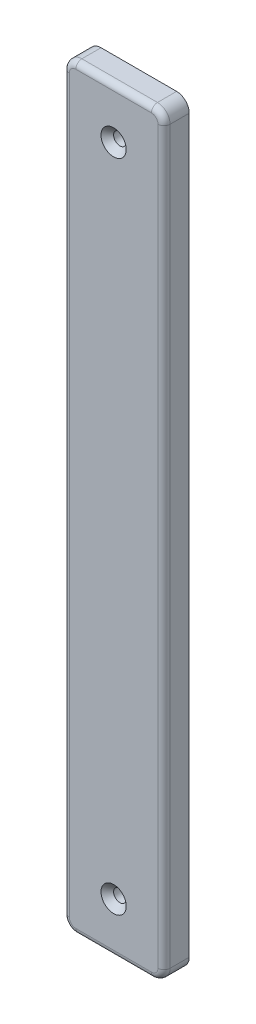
from build123d import *

# Parameters (mm, degrees)
SKETCH1_W          = 50.8
SKETCH1_H          = 381
BASE_EXTRUDE_DEPTH = 12.7
SKETCH2_R          = 3.175
CUT_EXTRUDE1_DEPTH = 193.605036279
CHAMFER1_SIZE      = 3.175
FILLET1_R          = 6.35
FILLET2_R          = 3.048


with BuildPart() as part:
    # Sketch1 → Base-Extrude (new body)
    with BuildSketch(Plane.XY):
        Rectangle(SKETCH1_W, SKETCH1_H)
    extrude(amount=BASE_EXTRUDE_DEPTH)

    # Sketch2 → Cut-Extrude1 (cut, through all)
    with BuildSketch(Plane.XY.offset(12.7)):
        with Locations((0, -165.1)):
            Circle(SKETCH2_R)
        with Locations((0, 165.1)):
            Circle(SKETCH2_R)
    extrude(amount=-CUT_EXTRUDE1_DEPTH, mode=Mode.SUBTRACT)

    # Chamfer1
    chamfer1_edges = [part.edges().sort_by_distance(p)[0] for p in [
        (-3.175, -165.1, 12.7),
        (-3.175, 165.1, 12.7),
    ]]
    chamfer(chamfer1_edges, length=CHAMFER1_SIZE)

    # Fillet1
    fillet1_edges = [part.edges().sort_by_distance(p)[0] for p in [
        (25.4, -190.5, 6.35),
        (-25.4, -190.5, 6.35),
        (-25.4, 190.5, 6.35),
        (25.4, 190.5, 6.35),
    ]]
    fillet(fillet1_edges, radius=FILLET1_R)

    # Fillet2
    fillet2_edges = [part.edges().sort_by_distance(p)[0] for p in [
        (25.4, 0, 12.7),
        (0, -190.5, 12.7),
        (0, 190.5, 12.7),
        (-25.4, 0, 12.7),
        (23.540128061, 188.640128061, 12.7),
        (-23.540128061, 188.640128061, 12.7),
        (-23.540128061, -188.640128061, 12.7),
        (23.540128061, -188.640128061, 12.7),
    ]]
    fillet(fillet2_edges, radius=FILLET2_R)


solid = part.part
